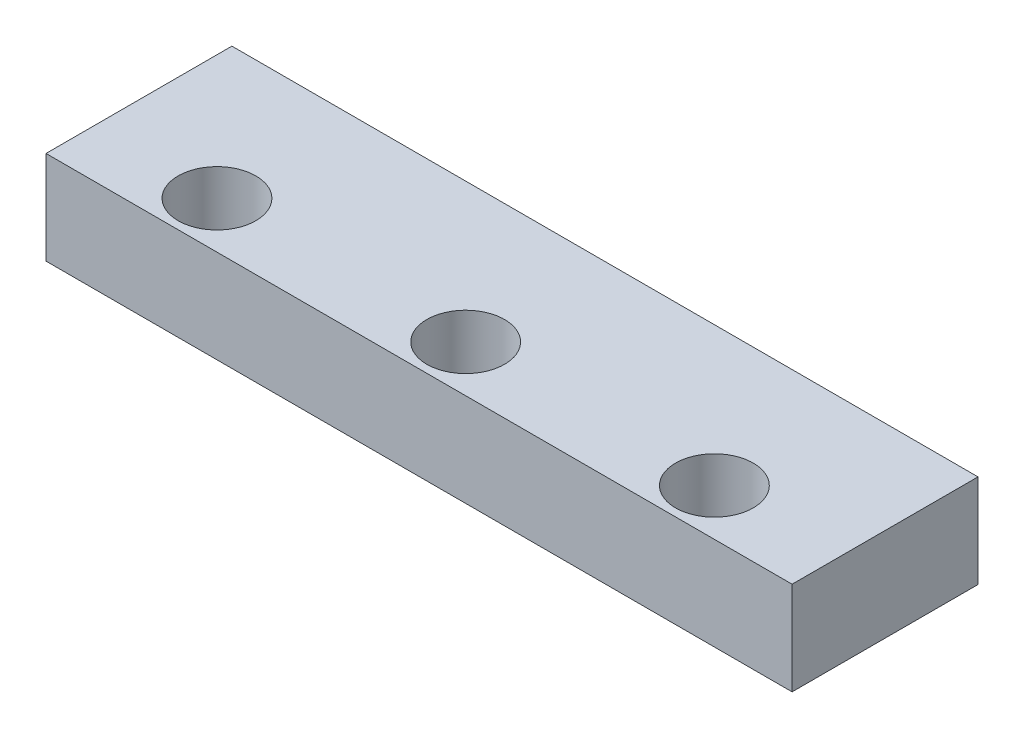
ISO-10303-21;
HEADER;
FILE_DESCRIPTION(('STEP AP214'),'2;1');
FILE_NAME('part.step','',(''),(''),'','','');
FILE_SCHEMA(('AUTOMOTIVE_DESIGN { 1 0 10303 214 1 1 1 1 }'));
ENDSEC;
DATA;
#1=APPLICATION_CONTEXT('core data for automotive mechanical design processes');
#2=APPLICATION_PROTOCOL_DEFINITION('international standard','automotive_design',2000,#1);
#3=PRODUCT_CONTEXT('',#1,'mechanical');
#4=PRODUCT('Part','Part','',(#3));
#5=PRODUCT_RELATED_PRODUCT_CATEGORY('part','',(#4));
#6=PRODUCT_DEFINITION_FORMATION('','',#4);
#7=PRODUCT_DEFINITION_CONTEXT('part definition',#1,'design');
#8=PRODUCT_DEFINITION('design','',#6,#7);
#9=PRODUCT_DEFINITION_SHAPE('','',#8);
#10=(LENGTH_UNIT() NAMED_UNIT(*) SI_UNIT(.MILLI.,.METRE.));
#11=(NAMED_UNIT(*) PLANE_ANGLE_UNIT() SI_UNIT($,.RADIAN.));
#12=(NAMED_UNIT(*) SI_UNIT($,.STERADIAN.) SOLID_ANGLE_UNIT());
#13=UNCERTAINTY_MEASURE_WITH_UNIT(LENGTH_MEASURE(1.E-05),#10,'distance_accuracy_value','');
#14=(GEOMETRIC_REPRESENTATION_CONTEXT(3) GLOBAL_UNCERTAINTY_ASSIGNED_CONTEXT((#13)) GLOBAL_UNIT_ASSIGNED_CONTEXT((#10,
#11,#12)) REPRESENTATION_CONTEXT('',''));
#15=CARTESIAN_POINT('',(0.,0.,0.));
#16=DIRECTION('',(0.,0.,1.));
#17=DIRECTION('',(1.,0.,0.));
#18=AXIS2_PLACEMENT_3D('',#15,#16,#17);
#19=CARTESIAN_POINT('',(0.,0.,30.));
#20=DIRECTION('',(1.,0.,0.));
#21=DIRECTION('',(0.,1.,0.));
#22=AXIS2_PLACEMENT_3D('',#19,#20,#21);
#23=PLANE('',#22);
#24=DIRECTION('',(0.,0.,-1.));
#25=VECTOR('',#24,1.);
#26=CARTESIAN_POINT('',(0.,0.,30.));
#27=LINE('',#26,#25);
#28=CARTESIAN_POINT('',(0.,0.,30.));
#29=VERTEX_POINT('',#28);
#30=CARTESIAN_POINT('',(0.,0.,0.0999999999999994));
#31=VERTEX_POINT('',#30);
#32=EDGE_CURVE('E85',#29,#31,#27,.T.);
#33=ORIENTED_EDGE('',*,*,#32,.T.);
#34=DIRECTION('',(0.,1.,0.));
#35=VECTOR('',#34,1.);
#36=CARTESIAN_POINT('',(0.,0.,0.1));
#37=LINE('',#36,#35);
#38=CARTESIAN_POINT('',(0.,-15.,0.100000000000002));
#39=VERTEX_POINT('',#38);
#40=EDGE_CURVE('E47',#39,#31,#37,.T.);
#41=ORIENTED_EDGE('',*,*,#40,.F.);
#42=DIRECTION('',(0.,0.,-1.));
#43=VECTOR('',#42,1.);
#44=CARTESIAN_POINT('',(0.,-15.,30.));
#45=LINE('',#44,#43);
#46=CARTESIAN_POINT('',(0.,-15.,30.));
#47=VERTEX_POINT('',#46);
#48=EDGE_CURVE('E11',#47,#39,#45,.T.);
#49=ORIENTED_EDGE('',*,*,#48,.F.);
#50=DIRECTION('',(0.,-1.,0.));
#51=VECTOR('',#50,1.);
#52=CARTESIAN_POINT('',(0.,0.,30.));
#53=LINE('',#52,#51);
#54=EDGE_CURVE('E92',#29,#47,#53,.T.);
#55=ORIENTED_EDGE('',*,*,#54,.F.);
#56=EDGE_LOOP('',(#33,#41,#49,#55));
#57=FACE_BOUND('',#56,.T.);
#58=ADVANCED_FACE('F33',(#57),#23,.F.);
#59=CARTESIAN_POINT('',(0.,-15.,30.));
#60=DIRECTION('',(0.,1.,0.));
#61=DIRECTION('',(0.,0.,1.));
#62=AXIS2_PLACEMENT_3D('',#59,#60,#61);
#63=PLANE('',#62);
#64=CARTESIAN_POINT('',(60.,-15.,22.5));
#65=DIRECTION('',(0.,1.,0.));
#66=DIRECTION('',(0.,0.,1.));
#67=AXIS2_PLACEMENT_3D('',#64,#65,#66);
#68=CIRCLE('',#67,4.00000000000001);
#69=CARTESIAN_POINT('',(60.,-15.,26.5));
#70=VERTEX_POINT('',#69);
#71=EDGE_CURVE('E118',#70,#70,#68,.T.);
#72=ORIENTED_EDGE('',*,*,#71,.T.);
#73=EDGE_LOOP('',(#72));
#74=FACE_BOUND('',#73,.T.);
#75=CARTESIAN_POINT('',(100.,-15.,22.5));
#76=DIRECTION('',(0.,1.,0.));
#77=DIRECTION('',(0.,0.,1.));
#78=AXIS2_PLACEMENT_3D('',#75,#76,#77);
#79=CIRCLE('',#78,4.00000000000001);
#80=CARTESIAN_POINT('',(100.,-15.,26.5));
#81=VERTEX_POINT('',#80);
#82=EDGE_CURVE('E123',#81,#81,#79,.T.);
#83=ORIENTED_EDGE('',*,*,#82,.T.);
#84=EDGE_LOOP('',(#83));
#85=FACE_BOUND('',#84,.T.);
#86=CARTESIAN_POINT('',(20.,-15.,22.5));
#87=DIRECTION('',(0.,1.,0.));
#88=DIRECTION('',(0.,0.,1.));
#89=AXIS2_PLACEMENT_3D('',#86,#87,#88);
#90=CIRCLE('',#89,4.);
#91=CARTESIAN_POINT('',(20.,-15.,26.5));
#92=VERTEX_POINT('',#91);
#93=EDGE_CURVE('E129',#92,#92,#90,.T.);
#94=ORIENTED_EDGE('',*,*,#93,.T.);
#95=EDGE_LOOP('',(#94));
#96=FACE_BOUND('',#95,.T.);
#97=ORIENTED_EDGE('',*,*,#48,.T.);
#98=DIRECTION('',(1.,0.,0.));
#99=VECTOR('',#98,1.);
#100=CARTESIAN_POINT('',(0.,-15.,0.100000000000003));
#101=LINE('',#100,#99);
#102=CARTESIAN_POINT('',(120.,-15.,0.100000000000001));
#103=VERTEX_POINT('',#102);
#104=EDGE_CURVE('E72',#39,#103,#101,.T.);
#105=ORIENTED_EDGE('',*,*,#104,.T.);
#106=DIRECTION('',(0.,0.,-1.));
#107=VECTOR('',#106,1.);
#108=CARTESIAN_POINT('',(120.,-15.,30.));
#109=LINE('',#108,#107);
#110=CARTESIAN_POINT('',(120.,-15.,30.));
#111=VERTEX_POINT('',#110);
#112=EDGE_CURVE('E40',#111,#103,#109,.T.);
#113=ORIENTED_EDGE('',*,*,#112,.F.);
#114=DIRECTION('',(1.,0.,0.));
#115=VECTOR('',#114,1.);
#116=CARTESIAN_POINT('',(0.,-15.,30.));
#117=LINE('',#116,#115);
#118=EDGE_CURVE('E89',#47,#111,#117,.T.);
#119=ORIENTED_EDGE('',*,*,#118,.F.);
#120=EDGE_LOOP('',(#97,#105,#113,#119));
#121=FACE_BOUND('',#120,.T.);
#122=ADVANCED_FACE('F88',(#74,#85,#96,#121),#63,.F.);
#123=CARTESIAN_POINT('',(120.,0.,30.));
#124=DIRECTION('',(-1.,0.,0.));
#125=DIRECTION('',(0.,0.,1.));
#126=AXIS2_PLACEMENT_3D('',#123,#124,#125);
#127=PLANE('',#126);
#128=ORIENTED_EDGE('',*,*,#112,.T.);
#129=DIRECTION('',(0.,1.,0.));
#130=VECTOR('',#129,1.);
#131=CARTESIAN_POINT('',(120.,0.,0.0999999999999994));
#132=LINE('',#131,#130);
#133=CARTESIAN_POINT('',(120.,0.,0.1));
#134=VERTEX_POINT('',#133);
#135=EDGE_CURVE('E75',#103,#134,#132,.T.);
#136=ORIENTED_EDGE('',*,*,#135,.T.);
#137=DIRECTION('',(0.,0.,-1.));
#138=VECTOR('',#137,1.);
#139=CARTESIAN_POINT('',(120.,0.,30.));
#140=LINE('',#139,#138);
#141=CARTESIAN_POINT('',(120.,0.,30.));
#142=VERTEX_POINT('',#141);
#143=EDGE_CURVE('E105',#142,#134,#140,.T.);
#144=ORIENTED_EDGE('',*,*,#143,.F.);
#145=DIRECTION('',(0.,1.,0.));
#146=VECTOR('',#145,1.);
#147=CARTESIAN_POINT('',(120.,0.,30.));
#148=LINE('',#147,#146);
#149=EDGE_CURVE('E91',#111,#142,#148,.T.);
#150=ORIENTED_EDGE('',*,*,#149,.F.);
#151=EDGE_LOOP('',(#128,#136,#144,#150));
#152=FACE_BOUND('',#151,.T.);
#153=ADVANCED_FACE('F108',(#152),#127,.F.);
#154=CARTESIAN_POINT('',(0.,0.,30.));
#155=DIRECTION('',(0.,-1.,0.));
#156=DIRECTION('',(0.,0.,-1.));
#157=AXIS2_PLACEMENT_3D('',#154,#155,#156);
#158=PLANE('',#157);
#159=CARTESIAN_POINT('',(60.,0.,22.5));
#160=DIRECTION('',(0.,1.,0.));
#161=DIRECTION('',(0.,0.,1.));
#162=AXIS2_PLACEMENT_3D('',#159,#160,#161);
#163=CIRCLE('',#162,6.25);
#164=CARTESIAN_POINT('',(60.,0.,28.75));
#165=VERTEX_POINT('',#164);
#166=EDGE_CURVE('E136',#165,#165,#163,.T.);
#167=ORIENTED_EDGE('',*,*,#166,.F.);
#168=EDGE_LOOP('',(#167));
#169=FACE_BOUND('',#168,.T.);
#170=CARTESIAN_POINT('',(100.,0.,22.5));
#171=DIRECTION('',(0.,1.,0.));
#172=DIRECTION('',(0.,0.,1.));
#173=AXIS2_PLACEMENT_3D('',#170,#171,#172);
#174=CIRCLE('',#173,6.25);
#175=CARTESIAN_POINT('',(100.,0.,28.75));
#176=VERTEX_POINT('',#175);
#177=EDGE_CURVE('E132',#176,#176,#174,.T.);
#178=ORIENTED_EDGE('',*,*,#177,.F.);
#179=EDGE_LOOP('',(#178));
#180=FACE_BOUND('',#179,.T.);
#181=CARTESIAN_POINT('',(20.,0.,22.5));
#182=DIRECTION('',(0.,1.,0.));
#183=DIRECTION('',(0.,0.,1.));
#184=AXIS2_PLACEMENT_3D('',#181,#182,#183);
#185=CIRCLE('',#184,6.25);
#186=CARTESIAN_POINT('',(20.,0.,28.75));
#187=VERTEX_POINT('',#186);
#188=EDGE_CURVE('E98',#187,#187,#185,.T.);
#189=ORIENTED_EDGE('',*,*,#188,.F.);
#190=EDGE_LOOP('',(#189));
#191=FACE_BOUND('',#190,.T.);
#192=ORIENTED_EDGE('',*,*,#143,.T.);
#193=DIRECTION('',(-1.,0.,0.));
#194=VECTOR('',#193,1.);
#195=CARTESIAN_POINT('',(133.,0.,0.1));
#196=LINE('',#195,#194);
#197=EDGE_CURVE('E86',#134,#31,#196,.T.);
#198=ORIENTED_EDGE('',*,*,#197,.T.);
#199=ORIENTED_EDGE('',*,*,#32,.F.);
#200=DIRECTION('',(-1.,0.,0.));
#201=VECTOR('',#200,1.);
#202=CARTESIAN_POINT('',(0.,0.,30.));
#203=LINE('',#202,#201);
#204=EDGE_CURVE('E55',#142,#29,#203,.T.);
#205=ORIENTED_EDGE('',*,*,#204,.F.);
#206=EDGE_LOOP('',(#192,#198,#199,#205));
#207=FACE_BOUND('',#206,.T.);
#208=ADVANCED_FACE('F111',(#169,#180,#191,#207),#158,.F.);
#209=CARTESIAN_POINT('',(0.,0.,30.));
#210=DIRECTION('',(0.,0.,1.));
#211=DIRECTION('',(1.,0.,0.));
#212=AXIS2_PLACEMENT_3D('',#209,#210,#211);
#213=PLANE('',#212);
#214=ORIENTED_EDGE('',*,*,#54,.T.);
#215=ORIENTED_EDGE('',*,*,#118,.T.);
#216=ORIENTED_EDGE('',*,*,#149,.T.);
#217=ORIENTED_EDGE('',*,*,#204,.T.);
#218=EDGE_LOOP('',(#214,#215,#216,#217));
#219=FACE_BOUND('',#218,.T.);
#220=ADVANCED_FACE('F94',(#219),#213,.T.);
#221=CARTESIAN_POINT('',(20.,-10.,22.5));
#222=DIRECTION('',(0.,1.,0.));
#223=DIRECTION('',(0.,0.,1.));
#224=AXIS2_PLACEMENT_3D('',#221,#222,#223);
#225=CYLINDRICAL_SURFACE('',#224,6.25);
#226=CARTESIAN_POINT('',(20.,-10.,22.5));
#227=DIRECTION('',(0.,1.,0.));
#228=DIRECTION('',(0.,0.,1.));
#229=AXIS2_PLACEMENT_3D('',#226,#227,#228);
#230=CIRCLE('',#229,6.25);
#231=CARTESIAN_POINT('',(20.,-10.,28.75));
#232=VERTEX_POINT('',#231);
#233=EDGE_CURVE('E95',#232,#232,#230,.T.);
#234=ORIENTED_EDGE('',*,*,#233,.F.);
#235=EDGE_LOOP('',(#234));
#236=FACE_BOUND('',#235,.T.);
#237=ORIENTED_EDGE('',*,*,#188,.T.);
#238=EDGE_LOOP('',(#237));
#239=FACE_BOUND('',#238,.T.);
#240=ADVANCED_FACE('F154',(#236,#239),#225,.F.);
#241=CARTESIAN_POINT('',(0.,-10.,0.));
#242=DIRECTION('',(0.,1.,0.));
#243=DIRECTION('',(0.,0.,1.));
#244=AXIS2_PLACEMENT_3D('',#241,#242,#243);
#245=PLANE('',#244);
#246=CARTESIAN_POINT('',(20.,-10.,22.5));
#247=DIRECTION('',(0.,1.,0.));
#248=DIRECTION('',(0.,0.,1.));
#249=AXIS2_PLACEMENT_3D('',#246,#247,#248);
#250=CIRCLE('',#249,4.);
#251=CARTESIAN_POINT('',(20.,-10.,26.5));
#252=VERTEX_POINT('',#251);
#253=EDGE_CURVE('E126',#252,#252,#250,.T.);
#254=ORIENTED_EDGE('',*,*,#253,.F.);
#255=EDGE_LOOP('',(#254));
#256=FACE_BOUND('',#255,.T.);
#257=ORIENTED_EDGE('',*,*,#233,.T.);
#258=EDGE_LOOP('',(#257));
#259=FACE_BOUND('',#258,.T.);
#260=ADVANCED_FACE('F156',(#256,#259),#245,.T.);
#261=CARTESIAN_POINT('',(100.,-10.,22.5));
#262=DIRECTION('',(0.,1.,0.));
#263=DIRECTION('',(0.,0.,1.));
#264=AXIS2_PLACEMENT_3D('',#261,#262,#263);
#265=CYLINDRICAL_SURFACE('',#264,6.25);
#266=CARTESIAN_POINT('',(100.,-10.,22.5));
#267=DIRECTION('',(0.,1.,0.));
#268=DIRECTION('',(0.,0.,1.));
#269=AXIS2_PLACEMENT_3D('',#266,#267,#268);
#270=CIRCLE('',#269,6.25);
#271=CARTESIAN_POINT('',(100.,-10.,28.75));
#272=VERTEX_POINT('',#271);
#273=EDGE_CURVE('E139',#272,#272,#270,.T.);
#274=ORIENTED_EDGE('',*,*,#273,.F.);
#275=EDGE_LOOP('',(#274));
#276=FACE_BOUND('',#275,.T.);
#277=ORIENTED_EDGE('',*,*,#177,.T.);
#278=EDGE_LOOP('',(#277));
#279=FACE_BOUND('',#278,.T.);
#280=ADVANCED_FACE('F145',(#276,#279),#265,.F.);
#281=CARTESIAN_POINT('',(0.,-10.,0.));
#282=DIRECTION('',(0.,1.,0.));
#283=DIRECTION('',(0.,0.,1.));
#284=AXIS2_PLACEMENT_3D('',#281,#282,#283);
#285=PLANE('',#284);
#286=CARTESIAN_POINT('',(100.,-10.,22.5));
#287=DIRECTION('',(0.,1.,0.));
#288=DIRECTION('',(0.,0.,1.));
#289=AXIS2_PLACEMENT_3D('',#286,#287,#288);
#290=CIRCLE('',#289,4.00000000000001);
#291=CARTESIAN_POINT('',(100.,-10.,26.5));
#292=VERTEX_POINT('',#291);
#293=EDGE_CURVE('E79',#292,#292,#290,.T.);
#294=ORIENTED_EDGE('',*,*,#293,.F.);
#295=EDGE_LOOP('',(#294));
#296=FACE_BOUND('',#295,.T.);
#297=ORIENTED_EDGE('',*,*,#273,.T.);
#298=EDGE_LOOP('',(#297));
#299=FACE_BOUND('',#298,.T.);
#300=ADVANCED_FACE('F202',(#296,#299),#285,.T.);
#301=CARTESIAN_POINT('',(60.,-10.,22.5));
#302=DIRECTION('',(0.,1.,0.));
#303=DIRECTION('',(0.,0.,1.));
#304=AXIS2_PLACEMENT_3D('',#301,#302,#303);
#305=CYLINDRICAL_SURFACE('',#304,6.25);
#306=CARTESIAN_POINT('',(60.,-10.,22.5));
#307=DIRECTION('',(0.,1.,0.));
#308=DIRECTION('',(0.,0.,1.));
#309=AXIS2_PLACEMENT_3D('',#306,#307,#308);
#310=CIRCLE('',#309,6.25);
#311=CARTESIAN_POINT('',(60.,-10.,28.75));
#312=VERTEX_POINT('',#311);
#313=EDGE_CURVE('E133',#312,#312,#310,.T.);
#314=ORIENTED_EDGE('',*,*,#313,.F.);
#315=EDGE_LOOP('',(#314));
#316=FACE_BOUND('',#315,.T.);
#317=ORIENTED_EDGE('',*,*,#166,.T.);
#318=EDGE_LOOP('',(#317));
#319=FACE_BOUND('',#318,.T.);
#320=ADVANCED_FACE('F195',(#316,#319),#305,.F.);
#321=CARTESIAN_POINT('',(0.,-10.,0.));
#322=DIRECTION('',(0.,1.,0.));
#323=DIRECTION('',(0.,0.,1.));
#324=AXIS2_PLACEMENT_3D('',#321,#322,#323);
#325=PLANE('',#324);
#326=CARTESIAN_POINT('',(60.,-10.,22.5));
#327=DIRECTION('',(0.,1.,0.));
#328=DIRECTION('',(0.,0.,1.));
#329=AXIS2_PLACEMENT_3D('',#326,#327,#328);
#330=CIRCLE('',#329,4.00000000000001);
#331=CARTESIAN_POINT('',(60.,-10.,26.5));
#332=VERTEX_POINT('',#331);
#333=EDGE_CURVE('E115',#332,#332,#330,.T.);
#334=ORIENTED_EDGE('',*,*,#333,.F.);
#335=EDGE_LOOP('',(#334));
#336=FACE_BOUND('',#335,.T.);
#337=ORIENTED_EDGE('',*,*,#313,.T.);
#338=EDGE_LOOP('',(#337));
#339=FACE_BOUND('',#338,.T.);
#340=ADVANCED_FACE('F185',(#336,#339),#325,.T.);
#341=CARTESIAN_POINT('',(20.,-20.,22.5));
#342=DIRECTION('',(0.,1.,0.));
#343=DIRECTION('',(0.,0.,1.));
#344=AXIS2_PLACEMENT_3D('',#341,#342,#343);
#345=CYLINDRICAL_SURFACE('',#344,4.);
#346=ORIENTED_EDGE('',*,*,#253,.T.);
#347=EDGE_LOOP('',(#346));
#348=FACE_BOUND('',#347,.T.);
#349=ORIENTED_EDGE('',*,*,#93,.F.);
#350=EDGE_LOOP('',(#349));
#351=FACE_BOUND('',#350,.T.);
#352=ADVANCED_FACE('F182',(#348,#351),#345,.F.);
#353=CARTESIAN_POINT('',(60.,-20.,22.5));
#354=DIRECTION('',(0.,1.,0.));
#355=DIRECTION('',(0.,0.,1.));
#356=AXIS2_PLACEMENT_3D('',#353,#354,#355);
#357=CYLINDRICAL_SURFACE('',#356,4.00000000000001);
#358=ORIENTED_EDGE('',*,*,#333,.T.);
#359=EDGE_LOOP('',(#358));
#360=FACE_BOUND('',#359,.T.);
#361=ORIENTED_EDGE('',*,*,#71,.F.);
#362=EDGE_LOOP('',(#361));
#363=FACE_BOUND('',#362,.T.);
#364=ADVANCED_FACE('F184',(#360,#363),#357,.F.);
#365=CARTESIAN_POINT('',(100.,-20.,22.5));
#366=DIRECTION('',(0.,1.,0.));
#367=DIRECTION('',(0.,0.,1.));
#368=AXIS2_PLACEMENT_3D('',#365,#366,#367);
#369=CYLINDRICAL_SURFACE('',#368,4.00000000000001);
#370=ORIENTED_EDGE('',*,*,#293,.T.);
#371=EDGE_LOOP('',(#370));
#372=FACE_BOUND('',#371,.T.);
#373=ORIENTED_EDGE('',*,*,#82,.F.);
#374=EDGE_LOOP('',(#373));
#375=FACE_BOUND('',#374,.T.);
#376=ADVANCED_FACE('F192',(#372,#375),#369,.F.);
#377=CARTESIAN_POINT('',(133.,0.,0.1));
#378=DIRECTION('',(0.,0.,1.));
#379=DIRECTION('',(0.,-1.,0.));
#380=AXIS2_PLACEMENT_3D('',#377,#378,#379);
#381=PLANE('',#380);
#382=ORIENTED_EDGE('',*,*,#40,.T.);
#383=ORIENTED_EDGE('',*,*,#197,.F.);
#384=ORIENTED_EDGE('',*,*,#135,.F.);
#385=ORIENTED_EDGE('',*,*,#104,.F.);
#386=EDGE_LOOP('',(#382,#383,#384,#385));
#387=FACE_BOUND('',#386,.T.);
#388=ADVANCED_FACE('F73',(#387),#381,.F.);
#389=CLOSED_SHELL('',(#58,#122,#153,#208,#220,#240,#260,#280,#300,#320,#340,#352,#364,#376,#388));
#390=MANIFOLD_SOLID_BREP('B2',#389);
#391=ADVANCED_BREP_SHAPE_REPRESENTATION('',(#18,#390),#14);
#392=SHAPE_DEFINITION_REPRESENTATION(#9,#391);
ENDSEC;
END-ISO-10303-21;
